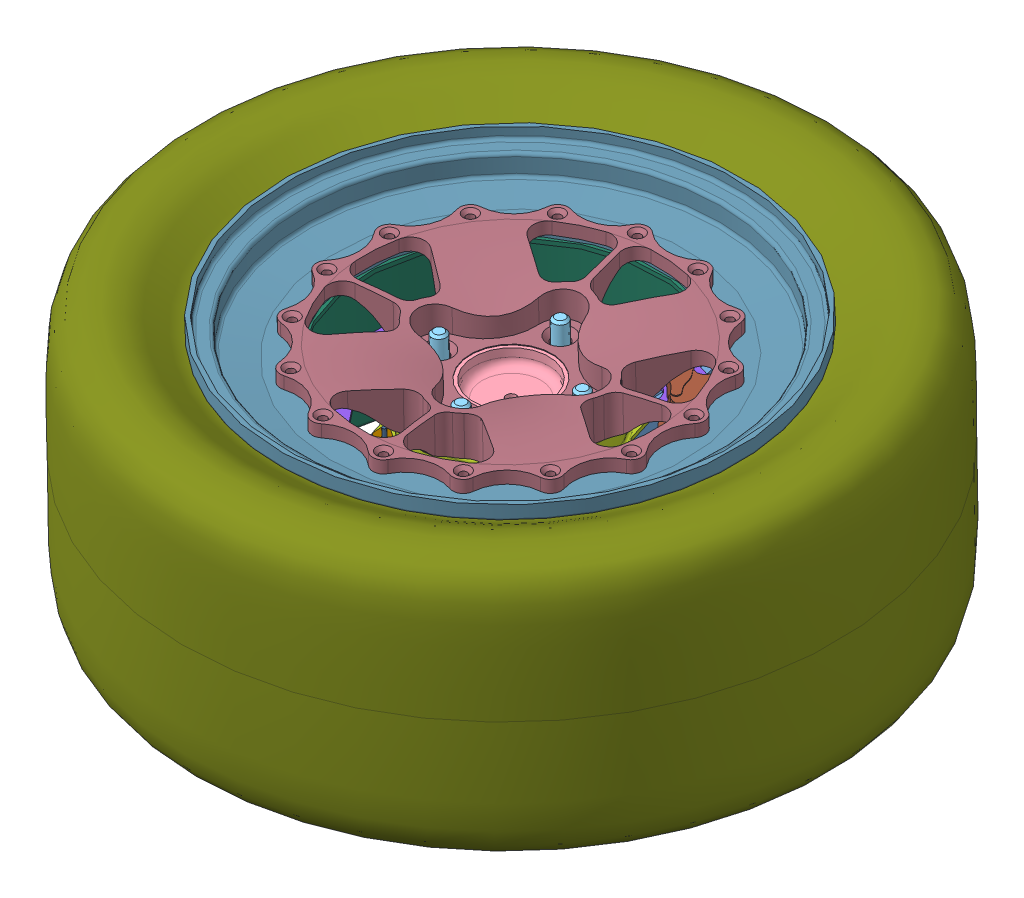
SolidWorks assembly Unspring Mass Assembly - Right.SLDASM, configuration Default (file format 4400). Lengths in mm.
Overall size (655.6 219.09 659.13).
49 component instances, 16 part files, 11 mates.
Components (placement in the parent):
- Upright Assembly - Mirror-3: Upright Assembly - Mirror.SLDASM [Default] at (1.0276 15.994 17.5776) size (187.69 75.94 260.67)
  - Upright - Mirror-1: Upright - Mirror.SLDPRT [AP Caliper] at (-28.1936 -601.3602 -253.5794) size (187.69 75.94 260.67)
  - Oil Seal-1: Oil Seal.SLDPRT [Default] at (-28.1936 8.8942 0.8085) x (0 -0.999848 -0.017452) z (-0.156462 -0.017237 0.987534) size (6.35 67.59 67.59)
  - Oil Seal-2: Oil Seal.SLDPRT [Default] at (-28.1936 -47.6122 -0.1778) x (0 0.999848 0.017452) z (-0.017452 -0.01745 0.999695) size (6.35 67.59 67.59)
  - Tapered Roller Bearing-1: Tapered Roller Bearing.SLDPRT [Default] at (-28.1936 -26.0254 0.199) x (0 -0.999848 -0.017452) z (0.934797 -0.006199 0.355129) size (17 55 55)
  - Tapered Roller Bearing-2: Tapered Roller Bearing.SLDPRT [Default] at (-28.1936 -15.7273 0.3787) x (0 0.999848 0.017452) z (0.612483 -0.013796 0.790364) size (17 55 55)
- Hub Assembly-1: Hub Assembly.SLDASM [Default] at (-27.166 37.2635 18.6021) x (0 0.999848 0.017452) z (0.568776 0.014354 -0.822367) size (81.66 92.75 92.75)
  - Hub - Aluminum-1: Hub - Aluminum.SLDPRT [SPLIT LINES] at (-63.5 0 0) size (68.33 92.75 92.75)
  - Wheel Stud-1: Wheel Stud.SLDPRT [LUG NUT CUT DOWN] at (-15.24 -33.676 33.676) x (1 0 0) z (0 0.091677 0.995789) size (41.27 15.88 15.88)
  - Wheel Stud-2: Wheel Stud.SLDPRT [LUG NUT CUT DOWN] at (-15.24 33.676 33.676) x (1 0 0) z (0 0.995789 -0.091677) size (41.27 15.88 15.88)
  - Wheel Stud-3: Wheel Stud.SLDPRT [LUG NUT CUT DOWN] at (-15.24 33.676 -33.676) x (1 0 0) z (0 -0.091677 -0.995789) size (41.27 15.88 15.88)
  - Wheel Stud-4: Wheel Stud.SLDPRT [LUG NUT CUT DOWN] at (-15.24 -33.676 -33.676) x (1 0 0) z (0 -0.995789 0.091677) size (41.27 15.88 15.88)
  - Hub Washer-1: Hub Washer.SLDPRT [NO_SPLITLINE] at (-20.0025 0 0) x (1 0 0) z (0 0.089607 0.995977) size (11.11 57.71 57.71)
- Brake Rotor Assembly-1: Brake Rotor Assembly.SLDASM [Default] at (3.214 50.726 15.9378) x (0 0.999848 0.017452) z (0.179405 -0.017169 0.983625) size (25.4 327.78 327.78)
  - Rotor Hat-1: Rotor Hat.SLDPRT [Default] at (-34.2242 30.4071 -2.5985) size (23.6 152.4 152.4)
  - Rotor - Cast Iron-1: Rotor - Cast Iron.SLDPRT [Default] at (-31.2397 30.4071 -2.5985) x (0 0.707107 0.707107) z (-1 0 0) size (231.78 231.78 3.17)
  - Rotor Washer-1: Rotor Washer.SLDPRT [Default] at (-31.2397 33.0101 -12.653) x (0 0.99948 0.032253) z (1 0 0) size (18.57 10.78 1.59)
  - Rotor Washer-27: Rotor Washer.SLDPRT [Chamfer] at (-34.4147 41.3596 -11.9484) x (0 -0.990749 -0.135705) z (-1 0 0) size (18.57 10.78 1.59)
  - Rotor Pin-6: Rotor Pin.SLDPRT [.5] at (-34.4534 30.4071 68.0135) x (0 0.996402 -0.084747) z (-1 0 0) size (6.36 6.36 12.79)
  - Rotor Washer-13: Rotor Washer.SLDPRT [Default] at (-31.2397 25.1381 -11.5488) x (0 0.729545 -0.683933) z (1 0 0) size (18.57 10.78 1.59)
  - Rotor Washer-14: Rotor Washer.SLDPRT [Default] at (-31.2397 20.3526 -5.2016) x (0 0.032253 -0.99948) z (1 0 0) size (18.57 10.78 1.59)
  - Rotor Washer-15: Rotor Washer.SLDPRT [Default] at (-31.2397 21.4568 2.6705) x (0 -0.683933 -0.729545) z (1 0 0) size (18.57 10.78 1.59)
  - Rotor Washer-16: Rotor Washer.SLDPRT [Default] at (-31.2397 27.804 7.456) x (0 -0.99948 -0.032253) z (1 0 0) size (18.57 10.78 1.59)
  - Rotor Washer-17: Rotor Washer.SLDPRT [Default] at (-31.2397 35.676 6.3518) x (0 -0.729545 0.683933) z (1 0 0) size (18.57 10.78 1.59)
  - Rotor Pin-7: Rotor Pin.SLDPRT [.5] at (-34.4534 80.3373 47.3317) x (0 0.644638 -0.764488) z (-1 0 0) size (6.36 6.36 12.79)
  - Rotor Pin-8: Rotor Pin.SLDPRT [.5] at (-34.4534 101.0191 -2.5985) x (0 -0.084747 -0.996402) z (-1 0 0) size (6.36 6.36 12.79)
  - Rotor Pin-9: Rotor Pin.SLDPRT [.5] at (-34.4534 80.3373 -52.5287) x (0 -0.764488 -0.644638) z (-1 0 0) size (6.36 6.36 12.79)
  - Rotor Pin-10: Rotor Pin.SLDPRT [.5] at (-34.4534 30.4071 -73.2105) x (0 -0.996402 0.084747) z (-1 0 0) size (6.36 6.36 12.79)
  - Rotor Pin-11: Rotor Pin.SLDPRT [.5] at (-34.4534 -19.5231 -52.5287) x (0 -0.644638 0.764488) z (-1 0 0) size (6.36 6.36 12.79)
  - Rotor Pin-12: Rotor Pin.SLDPRT [.5] at (-34.4534 -40.2049 -2.5985) x (0 0.084747 0.996402) z (-1 0 0) size (6.36 6.36 12.79)
  - Rotor Pin-13: Rotor Pin.SLDPRT [.5] at (-34.4534 -19.5231 47.3317) x (0 0.764488 0.644638) z (-1 0 0) size (6.36 6.36 12.79)
  - Rotor Washer-25: Rotor Washer.SLDPRT [Default] at (-31.2397 40.4616 0.0046) x (0 -0.032253 0.99948) z (1 0 0) size (18.57 10.78 1.59)
  - Rotor Washer-26: Rotor Washer.SLDPRT [Default] at (-31.2397 39.3573 -7.8675) x (0 0.683933 0.729545) z (1 0 0) size (18.57 10.78 1.59)
  - Rotor Washer-28: Rotor Washer.SLDPRT [Chamfer] at (-34.4147 31.5403 -16.9545) x (0 -0.796524 0.604608) z (-1 0 0) size (18.57 10.78 1.59)
  - Rotor Washer-29: Rotor Washer.SLDPRT [Chamfer] at (-34.4147 21.0572 -13.551) x (0 -0.135705 0.990749) z (-1 0 0) size (18.57 10.78 1.59)
  - Rotor Washer-30: Rotor Washer.SLDPRT [Chamfer] at (-34.4147 16.0511 -3.7317) x (0 0.604608 0.796524) z (-1 0 0) size (18.57 10.78 1.59)
  - Rotor Washer-31: Rotor Washer.SLDPRT [Chamfer] at (-34.4147 19.4545 6.7514) x (0 0.990749 0.135705) z (-1 0 0) size (18.57 10.78 1.59)
  - Rotor Washer-32: Rotor Washer.SLDPRT [Chamfer] at (-34.4147 29.2738 11.7575) x (0 0.796524 -0.604608) z (-1 0 0) size (18.57 10.78 1.59)
  - Rotor Washer-33: Rotor Washer.SLDPRT [Chamfer] at (-34.4147 39.757 8.3541) x (0 0.135705 -0.990749) z (-1 0 0) size (18.57 10.78 1.59)
  - Rotor Washer-34: Rotor Washer.SLDPRT [Chamfer] at (-34.4147 44.7631 -1.4652) x (0 -0.604608 -0.796524) z (-1 0 0) size (18.57 10.78 1.59)
- Brake Caliper Assembly-1: Brake Caliper Assembly.SLDASM [Default] at (73.5704 19.2772 -63.2993) x (-0.62932 0.013563 -0.777028) z (0 -0.999848 -0.017452) size (81.53 53.21 65.79)
  - Brake Caliper-2: Brake Caliper.SLDPRT [Default] at origin size (81.53 52.96 65.79)
  - Brake Pad-1: Brake Pad.SLDPRT [Default] at (0 -13.1318 -7.3025) size (39.75 43.48 7.11)
  - Brake Pad-2: Brake Pad.SLDPRT [Default] at (0 -13.1318 7.3025) x (-1 0 0) z (0 0 -1) size (39.75 43.48 7.11)
- Wheel Assembly-1: Wheel Assembly.SLDASM [Default] at (-27.166 65.4533 19.0941) x (0.983775 0.003131 -0.179378) z (0 0.999848 0.017452) size (563.63 563.63 207.68)
  - Wheel Center - Aluminum-1: Wheel Center - Aluminum.SLDPRT [Default] at origin size (260.35 260.35 36.14)
  - Wheel Shell - Outer-1: Wheel Shell - Outer.SLDPRT [Default] at (0 0 -3.175) x (0 0 1) z (-0.92388 -0.382683 0) size (31.75 355.6 355.6)
  - Wheel Shell - Inner-1: Wheel Shell - Inner.SLDPRT [Default] at (0 0 -3.175) x (0 0 1) z (-0.707107 -0.707107 0) size (151 355.6 355.6)
  - Tire-1: Tire.SLDPRT [Default] at (0 0 -62.8015) x (0 0 -1) z (0.993511 0.113735 0) size (207.68 509.04 509.04)
Mates (geometry in assembly coordinates):
- Concentric3: concentric anti-aligned: cylinder of Upright Assembly - Mirror-3/Tapered Roller Bearing-2 through (-27.166 0.2667 17.9563) axis (0 -0.999848 -0.017452) radius 15; cylinder of Hub Assembly-1/Hub - Aluminum-1 through (-27.166 183.3399 21.1519) axis (0 0.999848 0.017452) radius 15
- Coincident2: coincident anti-aligned: plane of Upright Assembly - Mirror-3/Tapered Roller Bearing-2 through (-42.5804 17.0556 30.1946) normal (0 0.999848 0.017452); plane of Hub Assembly-1/Hub Washer-1 through (-15.6427 17.0965 27.8544) normal (0 -0.999848 -0.017452)
- Coincident3: coincident anti-aligned: plane of Hub Assembly-1/Hub - Aluminum-1 through (25.0623 36.6332 54.7139) normal (0 0.999848 0.017452); plane of Brake Rotor Assembly-1/Rotor Hat-1 through (-60.7394 37.1567 24.7237) normal (0 -0.999848 -0.017452)
- Concentric9: concentric anti-aligned: cylinder of Hub Assembly-1/Hub - Aluminum-1 through (-27.166 -72.7366 16.682) axis (0 -0.999848 -0.017452) radius 31.75; cylinder of Wheel Assembly-1/Wheel Center - Aluminum-1 through (-27.166 40.0571 18.6509) axis (0 0.999848 0.017452) radius 31.75
- Coincident6: coincident anti-aligned: plane of Brake Rotor Assembly-1/Rotor Hat-1 through (-87.012 39.8666 29.5629) normal (0 0.999848 0.017452); plane of Wheel Assembly-1/Wheel Center - Aluminum-1 through (-27.166 40.0571 18.6509) normal (0 -0.999848 -0.017452)
- Concentric10: concentric anti-aligned: cylinder of Hub Assembly-1/Wheel Stud-3 through (-18.6218 -25.647 64.3634) axis (0 -0.999848 -0.017452) radius 5.5563; cylinder of Wheel Assembly-1/Wheel Center - Aluminum-1 through (-18.6218 39.2394 65.496) axis (0 0.999848 0.017452) radius 6.35
- Concentric11: concentric anti-aligned: cylinder of Hub Assembly-1/Hub - Aluminum-1 through (-27.166 -72.7366 16.682) axis (0 -0.999848 -0.017452) radius 31.75; cylinder of Brake Rotor Assembly-1/Rotor Hat-1 through (-27.166 42.3225 18.6904) axis (0 0.999848 0.017452) radius 31.877
- Concentric12: concentric anti-aligned: cylinder of Hub Assembly-1/Wheel Stud-1 through (-35.7101 -24.0116 -29.3269) axis (0 -0.999848 -0.017452) radius 5.5563; cylinder of Brake Rotor Assembly-1/Rotor Hat-1 through (-35.7101 17.2732 -28.6063) axis (0 0.999848 0.017452) radius 5.5245
- Concentric13: concentric anti-aligned: cylinder of Upright Assembly - Mirror-3/Upright - Mirror-1 through (58.7503 -42.8901 -11.1983) axis (0 0.999848 0.017452) radius 4.0005; cylinder of Brake Caliper Assembly-1/Brake Caliper-2 through (58.75 -8.266 -10.5943) axis (0 -0.999848 -0.017452) radius 4
- Concentric14: concentric anti-aligned: cylinder of Upright Assembly - Mirror-3/Upright - Mirror-1 through (18.4735 -42.0221 -60.9284) axis (0 0.999848 0.017452) radius 4.0005; cylinder of Brake Caliper Assembly-1/Brake Caliper-2 through (18.4735 -7.398 -60.324) axis (0 -0.999848 -0.017452) radius 4
- Coincident7: coincident anti-aligned: plane of Upright Assembly - Mirror-3/Upright - Mirror-1 through (34.4967 -8.6751 12.8429) normal (0 0.999848 0.017452); plane of Brake Caliper Assembly-1/Brake Caliper-2 through (18.4735 -7.398 -60.324) normal (0 -0.999848 -0.017452)
